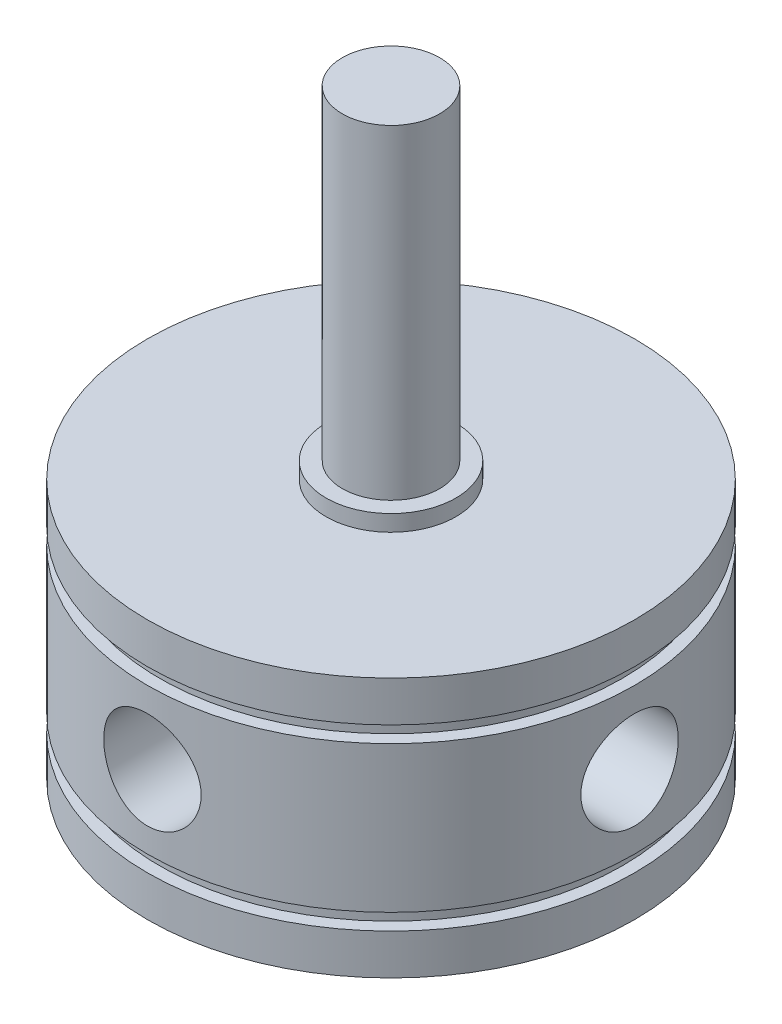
ISO-10303-21;
HEADER;
FILE_DESCRIPTION(('STEP AP214'),'2;1');
FILE_NAME('part.step','',(''),(''),'','','');
FILE_SCHEMA(('AUTOMOTIVE_DESIGN { 1 0 10303 214 1 1 1 1 }'));
ENDSEC;
DATA;
#1=APPLICATION_CONTEXT('core data for automotive mechanical design processes');
#2=APPLICATION_PROTOCOL_DEFINITION('international standard','automotive_design',2000,#1);
#3=PRODUCT_CONTEXT('',#1,'mechanical');
#4=PRODUCT('Part','Part','',(#3));
#5=PRODUCT_RELATED_PRODUCT_CATEGORY('part','',(#4));
#6=PRODUCT_DEFINITION_FORMATION('','',#4);
#7=PRODUCT_DEFINITION_CONTEXT('part definition',#1,'design');
#8=PRODUCT_DEFINITION('design','',#6,#7);
#9=PRODUCT_DEFINITION_SHAPE('','',#8);
#10=(LENGTH_UNIT() NAMED_UNIT(*) SI_UNIT(.MILLI.,.METRE.));
#11=(NAMED_UNIT(*) PLANE_ANGLE_UNIT() SI_UNIT($,.RADIAN.));
#12=(NAMED_UNIT(*) SI_UNIT($,.STERADIAN.) SOLID_ANGLE_UNIT());
#13=UNCERTAINTY_MEASURE_WITH_UNIT(LENGTH_MEASURE(1.E-05),#10,'distance_accuracy_value','');
#14=(GEOMETRIC_REPRESENTATION_CONTEXT(3) GLOBAL_UNCERTAINTY_ASSIGNED_CONTEXT((#13)) GLOBAL_UNIT_ASSIGNED_CONTEXT((#10,
#11,#12)) REPRESENTATION_CONTEXT('',''));
#15=CARTESIAN_POINT('',(0.,0.,0.));
#16=DIRECTION('',(0.,0.,1.));
#17=DIRECTION('',(1.,0.,0.));
#18=AXIS2_PLACEMENT_3D('',#15,#16,#17);
#19=CARTESIAN_POINT('',(0.,52.8834340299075,0.));
#20=DIRECTION('',(0.,1.,0.));
#21=DIRECTION('',(-1.,0.,0.));
#22=AXIS2_PLACEMENT_3D('',#19,#20,#21);
#23=CYLINDRICAL_SURFACE('',#22,15.);
#24=CARTESIAN_POINT('',(3.,12.,14.6969384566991));
#25=CARTESIAN_POINT('',(2.99999383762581,11.8333068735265,14.6969417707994));
#26=CARTESIAN_POINT('',(2.98605951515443,11.66653613,14.699805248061));
#27=CARTESIAN_POINT('',(2.93073685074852,11.3377124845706,14.7109329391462));
#28=CARTESIAN_POINT('',(2.88932654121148,11.1756634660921,14.7192014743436));
#29=CARTESIAN_POINT('',(2.78038734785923,10.8610880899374,14.7401662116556));
#30=CARTESIAN_POINT('',(2.71288444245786,10.7085524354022,14.7528580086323));
#31=CARTESIAN_POINT('',(2.55374732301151,10.4169754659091,14.7812339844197));
#32=CARTESIAN_POINT('',(2.46211445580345,10.2779333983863,14.7969179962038));
#33=CARTESIAN_POINT('',(2.25593722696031,10.0153169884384,14.8297589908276));
#34=CARTESIAN_POINT('',(2.14111696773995,9.89196123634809,14.8469321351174));
#35=CARTESIAN_POINT('',(1.89242036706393,9.66612739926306,14.8806741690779));
#36=CARTESIAN_POINT('',(1.75854269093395,9.56365077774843,14.8972430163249));
#37=CARTESIAN_POINT('',(1.47408406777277,9.38163594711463,14.9280838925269));
#38=CARTESIAN_POINT('',(1.32336770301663,9.30230545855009,14.9423346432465));
#39=CARTESIAN_POINT('',(1.01041245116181,9.17017518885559,14.9667521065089));
#40=CARTESIAN_POINT('',(0.848174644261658,9.11737292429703,14.9769192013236));
#41=CARTESIAN_POINT('',(0.519050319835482,9.04047841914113,14.9919096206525));
#42=CARTESIAN_POINT('',(0.352253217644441,9.01601706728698,14.9968015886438));
#43=CARTESIAN_POINT('',(0.016855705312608,8.99534714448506,15.0009276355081));
#44=CARTESIAN_POINT('',(-0.15174452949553,8.99913585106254,15.0001622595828));
#45=CARTESIAN_POINT('',(-0.483426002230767,9.03457854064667,14.9931130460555));
#46=CARTESIAN_POINT('',(-0.646551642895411,9.06583493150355,14.9869079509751));
#47=CARTESIAN_POINT('',(-0.965194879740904,9.15469509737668,14.9697653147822));
#48=CARTESIAN_POINT('',(-1.12071217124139,9.21229992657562,14.9588275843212));
#49=CARTESIAN_POINT('',(-1.42085838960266,9.35259012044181,14.9333188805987));
#50=CARTESIAN_POINT('',(-1.5654125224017,9.43543125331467,14.9187254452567));
#51=CARTESIAN_POINT('',(-1.83871513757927,9.6237272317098,14.8875140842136));
#52=CARTESIAN_POINT('',(-1.967461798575,9.72918467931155,14.8708959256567));
#53=CARTESIAN_POINT('',(-2.20785429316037,9.96190086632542,14.8371289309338));
#54=CARTESIAN_POINT('',(-2.31916294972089,10.0895075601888,14.8199758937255));
#55=CARTESIAN_POINT('',(-2.51885547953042,10.3617493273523,14.7873471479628));
#56=CARTESIAN_POINT('',(-2.60723891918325,10.5063847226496,14.7718714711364));
#57=CARTESIAN_POINT('',(-2.75868844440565,10.8090624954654,14.7443414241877));
#58=CARTESIAN_POINT('',(-2.82169994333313,10.967132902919,14.7322944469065));
#59=CARTESIAN_POINT('',(-2.92017102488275,11.291913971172,14.7130942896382));
#60=CARTESIAN_POINT('',(-2.95563419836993,11.4586235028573,14.7059404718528));
#61=CARTESIAN_POINT('',(-2.99749801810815,11.7928945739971,14.6974643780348));
#62=CARTESIAN_POINT('',(-3.00438557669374,11.960392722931,14.6960444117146));
#63=CARTESIAN_POINT('',(-2.99021288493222,12.2941446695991,14.6989345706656));
#64=CARTESIAN_POINT('',(-2.96915421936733,12.4603985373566,14.7032443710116));
#65=CARTESIAN_POINT('',(-2.90010662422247,12.7853059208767,14.7170169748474));
#66=CARTESIAN_POINT('',(-2.8523778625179,12.9440170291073,14.7264299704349));
#67=CARTESIAN_POINT('',(-2.73162310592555,13.2511898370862,14.7493046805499));
#68=CARTESIAN_POINT('',(-2.65859502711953,13.3996506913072,14.7627667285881));
#69=CARTESIAN_POINT('',(-2.4882124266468,13.6842393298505,14.7924421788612));
#70=CARTESIAN_POINT('',(-2.39055323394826,13.8201811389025,14.8086891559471));
#71=CARTESIAN_POINT('',(-2.17408671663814,14.0739249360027,14.8420117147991));
#72=CARTESIAN_POINT('',(-2.05527721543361,14.1917250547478,14.8590873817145));
#73=CARTESIAN_POINT('',(-1.79769682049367,14.4076876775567,14.8924603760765));
#74=CARTESIAN_POINT('',(-1.65864749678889,14.50552096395,14.9087417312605));
#75=CARTESIAN_POINT('',(-1.36580368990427,14.6764376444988,14.9384138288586));
#76=CARTESIAN_POINT('',(-1.21200982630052,14.7495220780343,14.9518046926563));
#77=CARTESIAN_POINT('',(-0.89490804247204,14.8683866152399,14.974118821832));
#78=CARTESIAN_POINT('',(-0.731660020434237,14.9143215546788,14.9830673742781));
#79=CARTESIAN_POINT('',(-0.399568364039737,14.9780737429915,14.9955970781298));
#80=CARTESIAN_POINT('',(-0.230725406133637,14.995894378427,14.9991788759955));
#81=CARTESIAN_POINT('',(0.104618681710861,15.0027809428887,15.0005562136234));
#82=CARTESIAN_POINT('',(0.271109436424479,14.9923418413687,14.9984513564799));
#83=CARTESIAN_POINT('',(0.599913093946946,14.9440981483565,14.9889013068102));
#84=CARTESIAN_POINT('',(0.762226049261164,14.9062939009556,14.9814561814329));
#85=CARTESIAN_POINT('',(1.07775824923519,14.8046130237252,14.9620649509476));
#86=CARTESIAN_POINT('',(1.23099732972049,14.7407958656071,14.9501291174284));
#87=CARTESIAN_POINT('',(1.5246636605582,14.5889632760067,14.9230416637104));
#88=CARTESIAN_POINT('',(1.66508989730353,14.5009459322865,14.9078897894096));
#89=CARTESIAN_POINT('',(1.93159167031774,14.3015418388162,14.8757279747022));
#90=CARTESIAN_POINT('',(2.05739914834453,14.1898009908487,14.858692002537));
#91=CARTESIAN_POINT('',(2.28864785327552,13.9468492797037,14.8248366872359));
#92=CARTESIAN_POINT('',(2.39408424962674,13.8156338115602,14.8080173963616));
#93=CARTESIAN_POINT('',(2.58267665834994,13.5357620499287,14.7763002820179));
#94=CARTESIAN_POINT('',(2.66558044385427,13.3869331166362,14.7614251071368));
#95=CARTESIAN_POINT('',(2.80507214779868,13.0772016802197,14.7355571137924));
#96=CARTESIAN_POINT('',(2.86168393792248,12.9163102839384,14.7245607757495));
#97=CARTESIAN_POINT('',(2.93600741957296,12.6292126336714,14.7098904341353));
#98=CARTESIAN_POINT('',(2.95996169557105,12.5046437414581,14.7050635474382));
#99=CARTESIAN_POINT('',(2.99196005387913,12.2533981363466,14.6985863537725));
#100=CARTESIAN_POINT('',(3.00000468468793,12.1267214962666,14.6969359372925));
#101=CARTESIAN_POINT('',(3.,12.,14.6969384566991));
#102=B_SPLINE_CURVE_WITH_KNOTS('',3,(#24,#25,#26,#27,#28,#29,#30,#31,#32,#33,#34,#35,#36,#37,
#38,#39,#40,#41,#42,#43,#44,#45,#46,#47,#48,#49,#50,#51,#52,#53,#54,#55,#56,#57,#58,#59,#60,#61,
#62,#63,#64,#65,#66,#67,#68,#69,#70,#71,#72,#73,#74,#75,#76,#77,#78,#79,#80,#81,#82,#83,#84,#85,
#86,#87,#88,#89,#90,#91,#92,#93,#94,#95,#96,#97,#98,#99,#100,#101),.UNSPECIFIED.,.T.,.F.,(4,2,2,
2,2,2,2,2,2,2,2,2,2,2,2,2,2,2,2,2,2,2,2,2,2,2,2,2,2,2,2,2,2,2,2,2,2,2,4),(0.,0.499615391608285,
0.999630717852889,1.49914949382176,1.99864039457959,2.5044675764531,3.01033020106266,
3.52060201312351,4.03082604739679,4.53432746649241,5.03778036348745,5.53406368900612,
6.03036687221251,6.5297977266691,7.02928607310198,7.5374804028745,8.04568434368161,
8.5549758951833,9.06420105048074,9.5647127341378,10.0651960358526,10.5608802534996,
11.0566053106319,11.5587917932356,12.0610299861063,12.5709780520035,13.0809046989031,
13.5878944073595,14.0948230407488,14.5929305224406,15.0910317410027,15.5880005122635,
16.0850085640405,16.5900345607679,17.0951801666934,17.6057669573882,18.1158892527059,
18.4957141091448,18.8755258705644),.UNSPECIFIED.);
#103=CARTESIAN_POINT('',(3.,12.,14.6969384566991));
#104=VERTEX_POINT('',#103);
#105=EDGE_CURVE('E133',#104,#104,#102,.T.);
#106=ORIENTED_EDGE('',*,*,#105,.T.);
#107=EDGE_LOOP('',(#106));
#108=FACE_BOUND('',#107,.T.);
#109=CARTESIAN_POINT('',(-15.,15.,0.));
#110=CARTESIAN_POINT('',(-14.9999969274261,14.9999938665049,0.166730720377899));
#111=CARTESIAN_POINT('',(-14.9971915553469,14.986053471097,0.333538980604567));
#112=CARTESIAN_POINT('',(-14.9862709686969,14.9307044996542,0.662440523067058));
#113=CARTESIAN_POINT('',(-14.9781515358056,14.8892741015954,0.824529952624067));
#114=CARTESIAN_POINT('',(-14.9575094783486,14.7802761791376,1.13919091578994));
#115=CARTESIAN_POINT('',(-14.9449910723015,14.7127336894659,1.2917714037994));
#116=CARTESIAN_POINT('',(-14.9169119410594,14.5535032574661,1.58342396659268));
#117=CARTESIAN_POINT('',(-14.9013513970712,14.4618167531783,1.72249684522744));
#118=CARTESIAN_POINT('',(-14.8686649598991,14.2555845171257,1.9850804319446));
#119=CARTESIAN_POINT('',(-14.8515223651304,14.1407749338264,2.10838185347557));
#120=CARTESIAN_POINT('',(-14.8177254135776,13.8921227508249,2.33411026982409));
#121=CARTESIAN_POINT('',(-14.8010710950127,13.7582786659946,2.43653563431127));
#122=CARTESIAN_POINT('',(-14.7699732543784,13.4738514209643,2.61849526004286));
#123=CARTESIAN_POINT('',(-14.7555512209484,13.3231270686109,2.6978128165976));
#124=CARTESIAN_POINT('',(-14.7307880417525,13.0101545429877,2.82991699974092));
#125=CARTESIAN_POINT('',(-14.7204464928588,12.8479075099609,2.88270624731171));
#126=CARTESIAN_POINT('',(-14.7051841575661,12.5187469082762,2.95957589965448));
#127=CARTESIAN_POINT('',(-14.7001941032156,12.3519223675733,2.98402349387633));
#128=CARTESIAN_POINT('',(-14.6959912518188,12.0164705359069,3.00465638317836));
#129=CARTESIAN_POINT('',(-14.6967778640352,11.8478434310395,3.0008445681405));
#130=CARTESIAN_POINT('',(-14.7039765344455,11.5162596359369,2.96536371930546));
#131=CARTESIAN_POINT('',(-14.7103035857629,11.353255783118,2.93411562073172));
#132=CARTESIAN_POINT('',(-14.7277363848,11.034851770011,2.84531365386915));
#133=CARTESIAN_POINT('',(-14.7388423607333,10.8794519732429,2.78775852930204));
#134=CARTESIAN_POINT('',(-14.7646685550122,10.5794542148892,2.64757435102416));
#135=CARTESIAN_POINT('',(-14.7794126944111,10.4349363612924,2.56477845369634));
#136=CARTESIAN_POINT('',(-14.8108385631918,10.1616874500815,2.37658072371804));
#137=CARTESIAN_POINT('',(-14.827520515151,10.0329582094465,2.27117629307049));
#138=CARTESIAN_POINT('',(-14.8613106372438,9.79251179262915,2.03849980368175));
#139=CARTESIAN_POINT('',(-14.8784210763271,9.68114229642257,1.91086848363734));
#140=CARTESIAN_POINT('',(-14.9108654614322,9.48133846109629,1.63855507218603));
#141=CARTESIAN_POINT('',(-14.9261993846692,9.39290441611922,1.49387276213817));
#142=CARTESIAN_POINT('',(-14.9534007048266,9.24141747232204,1.19117816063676));
#143=CARTESIAN_POINT('',(-14.9652626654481,9.17840431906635,1.0331454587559));
#144=CARTESIAN_POINT('',(-14.9841422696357,9.07991857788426,0.708446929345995));
#145=CARTESIAN_POINT('',(-14.9911605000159,9.04444265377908,0.541782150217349));
#146=CARTESIAN_POINT('',(-14.999480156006,9.00253063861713,0.207538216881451));
#147=CARTESIAN_POINT('',(-15.0008752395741,8.99561874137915,0.0400209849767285));
#148=CARTESIAN_POINT('',(-14.9980515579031,9.0097495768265,-0.293774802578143));
#149=CARTESIAN_POINT('',(-14.9938331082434,9.03079073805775,-0.46005342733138));
#150=CARTESIAN_POINT('',(-14.9803149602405,9.09983512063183,-0.785116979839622));
#151=CARTESIAN_POINT('',(-14.9710612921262,9.14759420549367,-0.943955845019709));
#152=CARTESIAN_POINT('',(-14.948506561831,9.26845194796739,-1.251370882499));
#153=CARTESIAN_POINT('',(-14.9352051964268,9.34155250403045,-1.39994628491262));
#154=CARTESIAN_POINT('',(-14.9057973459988,9.5120474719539,-1.68462352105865));
#155=CARTESIAN_POINT('',(-14.8896585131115,9.6097283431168,-1.82055038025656));
#156=CARTESIAN_POINT('',(-14.8564420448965,9.8262275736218,-2.07425405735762));
#157=CARTESIAN_POINT('',(-14.8393643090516,9.94504819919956,-2.19202892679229));
#158=CARTESIAN_POINT('',(-14.8058791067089,10.2026200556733,-2.40792177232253));
#159=CARTESIAN_POINT('',(-14.7894858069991,10.341647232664,-2.50571310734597));
#160=CARTESIAN_POINT('',(-14.7595257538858,10.63443408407,-2.67655626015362));
#161=CARTESIAN_POINT('',(-14.7459588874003,10.7881931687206,-2.74960906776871));
#162=CARTESIAN_POINT('',(-14.7233022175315,11.1053047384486,-2.86845552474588));
#163=CARTESIAN_POINT('',(-14.7141892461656,11.2686025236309,-2.91439049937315));
#164=CARTESIAN_POINT('',(-14.7014231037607,11.6008003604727,-2.97812595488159));
#165=CARTESIAN_POINT('',(-14.6977692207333,11.769699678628,-2.99593010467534));
#166=CARTESIAN_POINT('',(-14.6963744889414,12.1050265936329,-3.00276273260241));
#167=CARTESIAN_POINT('',(-14.698527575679,12.271443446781,-2.99230736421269));
#168=CARTESIAN_POINT('',(-14.7082672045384,12.600094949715,-2.94405691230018));
#169=CARTESIAN_POINT('',(-14.7158537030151,12.7623296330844,-2.90626204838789));
#170=CARTESIAN_POINT('',(-14.7355579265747,13.0776831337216,-2.80463570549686));
#171=CARTESIAN_POINT('',(-14.7476646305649,13.2308230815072,-2.74086752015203));
#172=CARTESIAN_POINT('',(-14.7750514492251,13.5243111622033,-2.58916393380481));
#173=CARTESIAN_POINT('',(-14.7903318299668,13.6646582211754,-2.50122650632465));
#174=CARTESIAN_POINT('',(-14.8226688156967,13.9311467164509,-2.30191774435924));
#175=CARTESIAN_POINT('',(-14.839751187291,14.0570062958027,-2.19017366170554));
#176=CARTESIAN_POINT('',(-14.8735824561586,14.2883586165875,-1.94719310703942));
#177=CARTESIAN_POINT('',(-14.8903312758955,14.3938466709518,-1.81595216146));
#178=CARTESIAN_POINT('',(-14.9218149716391,14.5825039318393,-1.53605288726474));
#179=CARTESIAN_POINT('',(-14.9365269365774,14.66542800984,-1.3872266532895));
#180=CARTESIAN_POINT('',(-14.96205375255,14.8049583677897,-1.0774990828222));
#181=CARTESIAN_POINT('',(-14.9728721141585,14.8615883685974,-0.916608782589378));
#182=CARTESIAN_POINT('',(-14.9872911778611,14.9359558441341,-0.629464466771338));
#183=CARTESIAN_POINT('',(-14.9920290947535,14.9599295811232,-0.504844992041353));
#184=CARTESIAN_POINT('',(-14.9983846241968,14.9919537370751,-0.2534985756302));
#185=CARTESIAN_POINT('',(-15.0000023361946,15.0000046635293,-0.126771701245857));
#186=CARTESIAN_POINT('',(-15.,15.,0.));
#187=B_SPLINE_CURVE_WITH_KNOTS('',3,(#109,#110,#111,#112,#113,#114,#115,#116,#117,#118,#119,
#120,#121,#122,#123,#124,#125,#126,#127,#128,#129,#130,#131,#132,#133,#134,#135,#136,#137,#138,
#139,#140,#141,#142,#143,#144,#145,#146,#147,#148,#149,#150,#151,#152,#153,#154,#155,#156,#157,
#158,#159,#160,#161,#162,#163,#164,#165,#166,#167,#168,#169,#170,#171,#172,#173,#174,#175,#176,
#177,#178,#179,#180,#181,#182,#183,#184,#185,#186),.UNSPECIFIED.,.T.,.F.,(4,2,2,2,2,2,2,2,2,2,2,
2,2,2,2,2,2,2,2,2,2,2,2,2,2,2,2,2,2,2,2,2,2,2,2,2,2,2,4),(0.,0.499728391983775,0.99985395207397,
1.49950120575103,1.99911870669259,2.50479801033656,3.0105167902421,3.52083585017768,
4.03110448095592,4.53468555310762,5.03821512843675,5.53415181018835,6.03011217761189,
6.52942470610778,7.02879464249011,7.53714757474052,8.04550702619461,8.55465824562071,
9.06374777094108,9.56432207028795,10.064868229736,10.5609136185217,11.0569961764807,
11.5591519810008,12.0613616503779,12.5712188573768,13.081055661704,13.5882114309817,
14.0953010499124,14.593191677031,15.0910783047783,15.5877588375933,16.084481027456,
16.5896422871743,17.0949196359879,17.6054849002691,18.1155886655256,18.4955632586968,
18.8755257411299),.UNSPECIFIED.);
#188=CARTESIAN_POINT('',(-15.,15.,0.));
#189=VERTEX_POINT('',#188);
#190=EDGE_CURVE('E59',#189,#189,#187,.T.);
#191=ORIENTED_EDGE('',*,*,#190,.T.);
#192=EDGE_LOOP('',(#191));
#193=FACE_BOUND('',#192,.T.);
#194=CARTESIAN_POINT('',(15.,15.,0.));
#195=CARTESIAN_POINT('',(14.9999969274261,14.9999938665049,-0.1667307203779));
#196=CARTESIAN_POINT('',(14.9971915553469,14.986053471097,-0.333538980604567));
#197=CARTESIAN_POINT('',(14.9862709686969,14.9307044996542,-0.662440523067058));
#198=CARTESIAN_POINT('',(14.9781515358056,14.8892741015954,-0.824529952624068));
#199=CARTESIAN_POINT('',(14.9575094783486,14.7802761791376,-1.13919091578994));
#200=CARTESIAN_POINT('',(14.9449910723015,14.7127336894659,-1.2917714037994));
#201=CARTESIAN_POINT('',(14.9169119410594,14.5535032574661,-1.58342396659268));
#202=CARTESIAN_POINT('',(14.9013513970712,14.4618167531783,-1.72249684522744));
#203=CARTESIAN_POINT('',(14.8686649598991,14.2555845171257,-1.9850804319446));
#204=CARTESIAN_POINT('',(14.8515223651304,14.1407749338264,-2.10838185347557));
#205=CARTESIAN_POINT('',(14.8177254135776,13.8921227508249,-2.33411026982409));
#206=CARTESIAN_POINT('',(14.8010710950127,13.7582786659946,-2.43653563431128));
#207=CARTESIAN_POINT('',(14.7699732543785,13.4738514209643,-2.61849526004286));
#208=CARTESIAN_POINT('',(14.7555512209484,13.3231270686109,-2.6978128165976));
#209=CARTESIAN_POINT('',(14.7307880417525,13.0101545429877,-2.82991699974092));
#210=CARTESIAN_POINT('',(14.7204464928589,12.8479075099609,-2.88270624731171));
#211=CARTESIAN_POINT('',(14.7051841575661,12.5187469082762,-2.95957589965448));
#212=CARTESIAN_POINT('',(14.7001941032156,12.3519223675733,-2.98402349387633));
#213=CARTESIAN_POINT('',(14.6959912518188,12.0164705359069,-3.00465638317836));
#214=CARTESIAN_POINT('',(14.6967778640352,11.8478434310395,-3.0008445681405));
#215=CARTESIAN_POINT('',(14.7039765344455,11.516259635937,-2.96536371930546));
#216=CARTESIAN_POINT('',(14.7103035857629,11.353255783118,-2.93411562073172));
#217=CARTESIAN_POINT('',(14.7277363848,11.034851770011,-2.84531365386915));
#218=CARTESIAN_POINT('',(14.7388423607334,10.8794519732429,-2.78775852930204));
#219=CARTESIAN_POINT('',(14.7646685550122,10.5794542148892,-2.64757435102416));
#220=CARTESIAN_POINT('',(14.7794126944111,10.4349363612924,-2.56477845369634));
#221=CARTESIAN_POINT('',(14.8108385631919,10.1616874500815,-2.37658072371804));
#222=CARTESIAN_POINT('',(14.827520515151,10.0329582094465,-2.27117629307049));
#223=CARTESIAN_POINT('',(14.8613106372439,9.79251179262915,-2.03849980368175));
#224=CARTESIAN_POINT('',(14.8784210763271,9.68114229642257,-1.91086848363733));
#225=CARTESIAN_POINT('',(14.9108654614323,9.48133846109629,-1.63855507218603));
#226=CARTESIAN_POINT('',(14.9261993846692,9.39290441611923,-1.49387276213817));
#227=CARTESIAN_POINT('',(14.9534007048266,9.24141747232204,-1.19117816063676));
#228=CARTESIAN_POINT('',(14.9652626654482,9.17840431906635,-1.0331454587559));
#229=CARTESIAN_POINT('',(14.9841422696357,9.07991857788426,-0.708446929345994));
#230=CARTESIAN_POINT('',(14.9911605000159,9.04444265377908,-0.541782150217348));
#231=CARTESIAN_POINT('',(14.999480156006,9.00253063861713,-0.207538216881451));
#232=CARTESIAN_POINT('',(15.0008752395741,8.99561874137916,-0.0400209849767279));
#233=CARTESIAN_POINT('',(14.9980515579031,9.00974957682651,0.293774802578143));
#234=CARTESIAN_POINT('',(14.9938331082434,9.03079073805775,0.46005342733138));
#235=CARTESIAN_POINT('',(14.9803149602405,9.09983512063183,0.785116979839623));
#236=CARTESIAN_POINT('',(14.9710612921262,9.14759420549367,0.943955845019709));
#237=CARTESIAN_POINT('',(14.948506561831,9.26845194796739,1.251370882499));
#238=CARTESIAN_POINT('',(14.9352051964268,9.34155250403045,1.39994628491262));
#239=CARTESIAN_POINT('',(14.9057973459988,9.5120474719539,1.68462352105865));
#240=CARTESIAN_POINT('',(14.8896585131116,9.6097283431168,1.82055038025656));
#241=CARTESIAN_POINT('',(14.8564420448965,9.82622757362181,2.07425405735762));
#242=CARTESIAN_POINT('',(14.8393643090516,9.94504819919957,2.19202892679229));
#243=CARTESIAN_POINT('',(14.8058791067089,10.2026200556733,2.40792177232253));
#244=CARTESIAN_POINT('',(14.7894858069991,10.341647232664,2.50571310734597));
#245=CARTESIAN_POINT('',(14.7595257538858,10.63443408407,2.67655626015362));
#246=CARTESIAN_POINT('',(14.7459588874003,10.7881931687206,2.74960906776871));
#247=CARTESIAN_POINT('',(14.7233022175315,11.1053047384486,2.86845552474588));
#248=CARTESIAN_POINT('',(14.7141892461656,11.2686025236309,2.91439049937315));
#249=CARTESIAN_POINT('',(14.7014231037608,11.6008003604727,2.97812595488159));
#250=CARTESIAN_POINT('',(14.6977692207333,11.769699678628,2.99593010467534));
#251=CARTESIAN_POINT('',(14.6963744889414,12.1050265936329,3.00276273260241));
#252=CARTESIAN_POINT('',(14.698527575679,12.271443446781,2.99230736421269));
#253=CARTESIAN_POINT('',(14.7082672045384,12.600094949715,2.94405691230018));
#254=CARTESIAN_POINT('',(14.7158537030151,12.7623296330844,2.90626204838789));
#255=CARTESIAN_POINT('',(14.7355579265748,13.0776831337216,2.80463570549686));
#256=CARTESIAN_POINT('',(14.7476646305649,13.2308230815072,2.74086752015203));
#257=CARTESIAN_POINT('',(14.7750514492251,13.5243111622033,2.58916393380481));
#258=CARTESIAN_POINT('',(14.7903318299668,13.6646582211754,2.50122650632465));
#259=CARTESIAN_POINT('',(14.8226688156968,13.9311467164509,2.30191774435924));
#260=CARTESIAN_POINT('',(14.839751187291,14.0570062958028,2.19017366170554));
#261=CARTESIAN_POINT('',(14.8735824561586,14.2883586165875,1.94719310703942));
#262=CARTESIAN_POINT('',(14.8903312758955,14.3938466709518,1.81595216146));
#263=CARTESIAN_POINT('',(14.9218149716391,14.5825039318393,1.53605288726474));
#264=CARTESIAN_POINT('',(14.9365269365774,14.66542800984,1.3872266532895));
#265=CARTESIAN_POINT('',(14.96205375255,14.8049583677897,1.0774990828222));
#266=CARTESIAN_POINT('',(14.9728721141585,14.8615883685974,0.916608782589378));
#267=CARTESIAN_POINT('',(14.9872911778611,14.9359558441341,0.629464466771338));
#268=CARTESIAN_POINT('',(14.9920290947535,14.9599295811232,0.504844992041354));
#269=CARTESIAN_POINT('',(14.9983846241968,14.9919537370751,0.253498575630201));
#270=CARTESIAN_POINT('',(15.0000023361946,15.0000046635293,0.126771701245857));
#271=CARTESIAN_POINT('',(15.,15.,0.));
#272=B_SPLINE_CURVE_WITH_KNOTS('',3,(#194,#195,#196,#197,#198,#199,#200,#201,#202,#203,#204,
#205,#206,#207,#208,#209,#210,#211,#212,#213,#214,#215,#216,#217,#218,#219,#220,#221,#222,#223,
#224,#225,#226,#227,#228,#229,#230,#231,#232,#233,#234,#235,#236,#237,#238,#239,#240,#241,#242,
#243,#244,#245,#246,#247,#248,#249,#250,#251,#252,#253,#254,#255,#256,#257,#258,#259,#260,#261,
#262,#263,#264,#265,#266,#267,#268,#269,#270,#271),.UNSPECIFIED.,.T.,.F.,(4,2,2,2,2,2,2,2,2,2,2,
2,2,2,2,2,2,2,2,2,2,2,2,2,2,2,2,2,2,2,2,2,2,2,2,2,2,2,4),(0.,0.499728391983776,0.99985395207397,
1.49950120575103,1.99911870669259,2.50479801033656,3.0105167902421,3.52083585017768,
4.03110448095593,4.53468555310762,5.03821512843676,5.53415181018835,6.03011217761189,
6.52942470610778,7.02879464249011,7.53714757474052,8.04550702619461,8.55465824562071,
9.06374777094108,9.56432207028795,10.064868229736,10.5609136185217,11.0569961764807,
11.5591519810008,12.0613616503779,12.5712188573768,13.081055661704,13.5882114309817,
14.0953010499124,14.593191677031,15.0910783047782,15.5877588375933,16.084481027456,
16.5896422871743,17.0949196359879,17.6054849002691,18.1155886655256,18.4955632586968,
18.8755257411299),.UNSPECIFIED.);
#273=CARTESIAN_POINT('',(15.,15.,0.));
#274=VERTEX_POINT('',#273);
#275=EDGE_CURVE('E73',#274,#274,#272,.T.);
#276=ORIENTED_EDGE('',*,*,#275,.T.);
#277=EDGE_LOOP('',(#276));
#278=FACE_BOUND('',#277,.T.);
#279=CARTESIAN_POINT('',(0.,16.5,0.));
#280=DIRECTION('',(0.,1.,0.));
#281=DIRECTION('',(-1.,0.,0.));
#282=AXIS2_PLACEMENT_3D('',#279,#280,#281);
#283=CIRCLE('',#282,15.);
#284=CARTESIAN_POINT('',(-15.,16.5,0.));
#285=VERTEX_POINT('',#284);
#286=EDGE_CURVE('E142',#285,#285,#283,.T.);
#287=ORIENTED_EDGE('',*,*,#286,.F.);
#288=EDGE_LOOP('',(#287));
#289=FACE_BOUND('',#288,.T.);
#290=CARTESIAN_POINT('',(0.,7.49999999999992,0.));
#291=DIRECTION('',(0.,1.,0.));
#292=DIRECTION('',(-1.,0.,0.));
#293=AXIS2_PLACEMENT_3D('',#290,#291,#292);
#294=CIRCLE('',#293,15.);
#295=CARTESIAN_POINT('',(-15.,7.49999999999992,0.));
#296=VERTEX_POINT('',#295);
#297=EDGE_CURVE('E145',#296,#296,#294,.T.);
#298=ORIENTED_EDGE('',*,*,#297,.T.);
#299=EDGE_LOOP('',(#298));
#300=FACE_BOUND('',#299,.T.);
#301=CARTESIAN_POINT('',(3.49227122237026,12.,-14.5878045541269));
#302=CARTESIAN_POINT('',(3.49227820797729,12.1666931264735,-14.5878049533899));
#303=CARTESIAN_POINT('',(3.50611715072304,12.33346387,-14.5845112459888));
#304=CARTESIAN_POINT('',(3.56095927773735,12.6622875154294,-14.5712159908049));
#305=CARTESIAN_POINT('',(3.60198419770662,12.8243365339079,-14.561209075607));
#306=CARTESIAN_POINT('',(3.70957671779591,13.1389119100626,-14.5341698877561));
#307=CARTESIAN_POINT('',(3.7761189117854,13.2914475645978,-14.5171446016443));
#308=CARTESIAN_POINT('',(3.93233832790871,13.5830245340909,-14.4756077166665));
#309=CARTESIAN_POINT('',(4.02201425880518,13.7220666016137,-14.4510965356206));
#310=CARTESIAN_POINT('',(4.22275349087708,13.9846830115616,-14.3937263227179));
#311=CARTESIAN_POINT('',(4.33407367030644,14.1080387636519,-14.3607653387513));
#312=CARTESIAN_POINT('',(4.57372933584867,14.3338726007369,-14.2862422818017));
#313=CARTESIAN_POINT('',(4.70206601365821,14.4363492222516,-14.244679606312));
#314=CARTESIAN_POINT('',(4.97290699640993,14.6183640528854,-14.1524135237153));
#315=CARTESIAN_POINT('',(5.11552503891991,14.6976945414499,-14.1016336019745));
#316=CARTESIAN_POINT('',(5.40947808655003,14.8298248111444,-13.9915027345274));
#317=CARTESIAN_POINT('',(5.56081227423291,14.882627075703,-13.9321525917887));
#318=CARTESIAN_POINT('',(5.8654354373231,14.9595215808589,-13.8066445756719));
#319=CARTESIAN_POINT('',(6.01867238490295,14.983982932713,-13.7405867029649));
#320=CARTESIAN_POINT('',(6.32438950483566,15.004652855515,-13.6025810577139));
#321=CARTESIAN_POINT('',(6.47686974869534,15.0008641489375,-13.5306338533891));
#322=CARTESIAN_POINT('',(6.77449612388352,14.9654214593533,-13.3840704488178));
#323=CARTESIAN_POINT('',(6.91971577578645,14.9341650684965,-13.3095068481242));
#324=CARTESIAN_POINT('',(7.20125983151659,14.8453049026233,-13.1593058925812));
#325=CARTESIAN_POINT('',(7.33758387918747,14.7877000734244,-13.0836684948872));
#326=CARTESIAN_POINT('',(7.59882829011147,14.6474098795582,-12.9337024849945));
#327=CARTESIAN_POINT('',(7.72367137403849,14.5645687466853,-12.8593851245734));
#328=CARTESIAN_POINT('',(7.95817717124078,14.3762727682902,-12.7155953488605));
#329=CARTESIAN_POINT('',(8.06783813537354,14.2708153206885,-12.6461234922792));
#330=CARTESIAN_POINT('',(8.27143717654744,14.0380991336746,-12.5139259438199));
#331=CARTESIAN_POINT('',(8.36506789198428,13.9104924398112,-12.4513389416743));
#332=CARTESIAN_POINT('',(8.5322612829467,13.6382506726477,-12.3373735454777));
#333=CARTESIAN_POINT('',(8.60582357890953,13.4936152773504,-12.2859953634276));
#334=CARTESIAN_POINT('',(8.73144876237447,13.1909375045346,-12.1970393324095));
#335=CARTESIAN_POINT('',(8.78346530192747,13.032867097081,-12.1594912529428));
#336=CARTESIAN_POINT('',(8.86459607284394,12.708086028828,-12.100474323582));
#337=CARTESIAN_POINT('',(8.89371328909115,12.5413764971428,-12.0790033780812));
#338=CARTESIAN_POINT('',(8.92807264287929,12.2071054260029,-12.0536290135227));
#339=CARTESIAN_POINT('',(8.9337147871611,12.039607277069,-12.0494312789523));
#340=CARTESIAN_POINT('',(8.92209140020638,11.705855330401,-12.0580402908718));
#341=CARTESIAN_POINT('',(8.90482716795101,11.5396014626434,-12.0708460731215));
#342=CARTESIAN_POINT('',(8.8480693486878,11.2146940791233,-12.1125090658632));
#343=CARTESIAN_POINT('',(8.80879050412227,11.0559829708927,-12.1412111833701));
#344=CARTESIAN_POINT('',(8.70901679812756,10.7488101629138,-12.2129758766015));
#345=CARTESIAN_POINT('',(8.64852018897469,10.6003493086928,-12.2560396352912));
#346=CARTESIAN_POINT('',(8.50664249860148,10.3157606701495,-12.3549415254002));
#347=CARTESIAN_POINT('',(8.42499948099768,10.1798188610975,-12.4109388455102));
#348=CARTESIAN_POINT('',(8.24289691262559,9.92607506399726,-12.5326220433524));
#349=CARTESIAN_POINT('',(8.14243542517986,9.80827494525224,-12.5983089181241));
#350=CARTESIAN_POINT('',(7.92309234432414,9.59231232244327,-12.737413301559));
#351=CARTESIAN_POINT('',(7.80395165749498,9.49447903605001,-12.8109340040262));
#352=CARTESIAN_POINT('',(7.55108500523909,9.32356235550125,-12.9615871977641));
#353=CARTESIAN_POINT('',(7.41735965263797,9.25047792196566,-13.0387195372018));
#354=CARTESIAN_POINT('',(7.13939819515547,9.1316133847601,-13.1929560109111));
#355=CARTESIAN_POINT('',(6.99522706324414,9.08567844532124,-13.2700577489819));
#356=CARTESIAN_POINT('',(6.69954509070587,9.02192625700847,-13.4217615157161));
#357=CARTESIAN_POINT('',(6.54803513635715,9.00410562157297,-13.4963638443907));
#358=CARTESIAN_POINT('',(6.24469226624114,8.99721905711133,-13.6393346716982));
#359=CARTESIAN_POINT('',(6.09291084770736,9.00765815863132,-13.7077890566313));
#360=CARTESIAN_POINT('',(5.79087750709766,9.05590185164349,-13.8380922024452));
#361=CARTESIAN_POINT('',(5.64062556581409,9.0937060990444,-13.8999410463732));
#362=CARTESIAN_POINT('',(5.3464611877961,9.19538697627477,-14.0157162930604));
#363=CARTESIAN_POINT('',(5.20253511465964,9.25920413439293,-14.0696603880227));
#364=CARTESIAN_POINT('',(4.92493537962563,9.41103672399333,-14.1692195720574));
#365=CARTESIAN_POINT('',(4.79126252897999,9.4990540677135,-14.2148340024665));
#366=CARTESIAN_POINT('',(4.53613772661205,9.69845816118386,-14.298314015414));
#367=CARTESIAN_POINT('',(4.41491771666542,9.81019900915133,-14.3360427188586));
#368=CARTESIAN_POINT('',(4.1910273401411,10.0531507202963,-14.4030893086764));
#369=CARTESIAN_POINT('',(4.08836137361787,10.1843661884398,-14.4324052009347));
#370=CARTESIAN_POINT('',(3.9040343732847,10.4642379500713,-14.4833623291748));
#371=CARTESIAN_POINT('',(3.82261150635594,10.6130668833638,-14.5049174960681));
#372=CARTESIAN_POINT('',(3.68525680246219,10.9227983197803,-14.5404248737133));
#373=CARTESIAN_POINT('',(3.62930184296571,11.0836897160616,-14.5543839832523));
#374=CARTESIAN_POINT('',(3.55574193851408,11.3707873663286,-14.5724985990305));
#375=CARTESIAN_POINT('',(3.53199206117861,11.4953562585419,-14.5782474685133));
#376=CARTESIAN_POINT('',(3.50025431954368,11.7466018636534,-14.5859002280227));
#377=CARTESIAN_POINT('',(3.49226591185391,11.8732785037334,-14.5878042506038));
#378=CARTESIAN_POINT('',(3.49227122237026,12.,-14.5878045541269));
#379=B_SPLINE_CURVE_WITH_KNOTS('',3,(#301,#302,#303,#304,#305,#306,#307,#308,#309,#310,#311,
#312,#313,#314,#315,#316,#317,#318,#319,#320,#321,#322,#323,#324,#325,#326,#327,#328,#329,#330,
#331,#332,#333,#334,#335,#336,#337,#338,#339,#340,#341,#342,#343,#344,#345,#346,#347,#348,#349,
#350,#351,#352,#353,#354,#355,#356,#357,#358,#359,#360,#361,#362,#363,#364,#365,#366,#367,#368,
#369,#370,#371,#372,#373,#374,#375,#376,#377,#378),.UNSPECIFIED.,.T.,.F.,(4,2,2,2,2,2,2,2,2,2,2,
2,2,2,2,2,2,2,2,2,2,2,2,2,2,2,2,2,2,2,2,2,2,2,2,2,2,2,4),(0.,0.499615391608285,
0.999630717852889,1.49914949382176,1.99864039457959,2.5044675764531,3.01033020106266,
3.5206020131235,4.03082604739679,4.53432746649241,5.03778036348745,5.53406368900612,
6.03036687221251,6.52979772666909,7.02928607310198,7.5374804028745,8.04568434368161,
8.5549758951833,9.06420105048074,9.5647127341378,10.0651960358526,10.5608802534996,
11.0566053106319,11.5587917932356,12.0610299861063,12.5709780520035,13.0809046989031,
13.5878944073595,14.0948230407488,14.5929305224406,15.0910317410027,15.5880005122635,
16.0850085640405,16.5900345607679,17.0951801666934,17.6057669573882,18.1158892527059,
18.4957141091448,18.8755258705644),.UNSPECIFIED.);
#380=CARTESIAN_POINT('',(3.49227122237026,12.,-14.5878045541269));
#381=VERTEX_POINT('',#380);
#382=EDGE_CURVE('E148',#381,#381,#379,.T.);
#383=ORIENTED_EDGE('',*,*,#382,.F.);
#384=EDGE_LOOP('',(#383));
#385=FACE_BOUND('',#384,.T.);
#386=ADVANCED_FACE('F34',(#108,#193,#278,#289,#300,#385),#23,.T.);
#387=CARTESIAN_POINT('',(-15.,12.,0.));
#388=DIRECTION('',(1.,0.,0.));
#389=DIRECTION('',(0.,1.,0.));
#390=AXIS2_PLACEMENT_3D('',#387,#388,#389);
#391=CYLINDRICAL_SURFACE('',#390,3.);
#392=ORIENTED_EDGE('',*,*,#190,.F.);
#393=EDGE_LOOP('',(#392));
#394=FACE_BOUND('',#393,.T.);
#395=CARTESIAN_POINT('',(0.,12.,0.));
#396=DIRECTION('',(0.843391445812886,0.,-0.537299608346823));
#397=DIRECTION('',(0.537299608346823,0.,0.843391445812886));
#398=AXIS2_PLACEMENT_3D('',#395,#396,#397);
#399=ELLIPSE('',#398,3.55706714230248,3.);
#400=CARTESIAN_POINT('',(0.,15.,0.));
#401=VERTEX_POINT('',#400);
#402=CARTESIAN_POINT('',(0.,8.99999999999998,0.));
#403=VERTEX_POINT('',#402);
#404=EDGE_CURVE('E12',#401,#403,#399,.F.);
#405=ORIENTED_EDGE('',*,*,#404,.F.);
#406=CARTESIAN_POINT('',(0.,12.,0.));
#407=DIRECTION('',(0.707106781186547,0.,0.707106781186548));
#408=DIRECTION('',(0.707106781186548,0.,-0.707106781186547));
#409=AXIS2_PLACEMENT_3D('',#406,#407,#408);
#410=ELLIPSE('',#409,4.24264068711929,3.);
#411=EDGE_CURVE('E54',#401,#403,#410,.T.);
#412=ORIENTED_EDGE('',*,*,#411,.T.);
#413=EDGE_LOOP('',(#405,#412));
#414=FACE_BOUND('',#413,.T.);
#415=ADVANCED_FACE('F64',(#394,#414),#391,.F.);
#416=ORIENTED_EDGE('',*,*,#275,.F.);
#417=EDGE_LOOP('',(#416));
#418=FACE_BOUND('',#417,.T.);
#419=CARTESIAN_POINT('',(0.,12.,0.));
#420=DIRECTION('',(0.537299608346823,0.,0.843391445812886));
#421=DIRECTION('',(0.843391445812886,0.,-0.537299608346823));
#422=AXIS2_PLACEMENT_3D('',#419,#420,#421);
#423=ELLIPSE('',#422,5.58347699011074,3.);
#424=EDGE_CURVE('E42',#403,#401,#423,.T.);
#425=ORIENTED_EDGE('',*,*,#424,.F.);
#426=CARTESIAN_POINT('',(0.,12.,0.));
#427=DIRECTION('',(0.707106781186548,0.,-0.707106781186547));
#428=DIRECTION('',(0.707106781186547,0.,0.707106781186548));
#429=AXIS2_PLACEMENT_3D('',#426,#427,#428);
#430=ELLIPSE('',#429,4.24264068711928,3.);
#431=EDGE_CURVE('E52',#403,#401,#430,.F.);
#432=ORIENTED_EDGE('',*,*,#431,.T.);
#433=EDGE_LOOP('',(#425,#432));
#434=FACE_BOUND('',#433,.T.);
#435=ADVANCED_FACE('F51',(#418,#434),#391,.F.);
#436=CARTESIAN_POINT('',(3.,0.,0.));
#437=DIRECTION('',(0.,1.,0.));
#438=DIRECTION('',(-1.,0.,0.));
#439=AXIS2_PLACEMENT_3D('',#436,#437,#438);
#440=PLANE('',#439);
#441=CARTESIAN_POINT('',(0.,0.,0.));
#442=DIRECTION('',(0.,1.,0.));
#443=DIRECTION('',(-1.,0.,0.));
#444=AXIS2_PLACEMENT_3D('',#441,#442,#443);
#445=CIRCLE('',#444,2.99999999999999);
#446=CARTESIAN_POINT('',(-2.99999999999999,0.,0.));
#447=VERTEX_POINT('',#446);
#448=EDGE_CURVE('E149',#447,#447,#445,.T.);
#449=ORIENTED_EDGE('',*,*,#448,.F.);
#450=EDGE_LOOP('',(#449));
#451=FACE_BOUND('',#450,.T.);
#452=ADVANCED_FACE('F36',(#451),#440,.F.);
#453=CARTESIAN_POINT('',(0.,41.,0.));
#454=DIRECTION('',(0.,-1.,0.));
#455=DIRECTION('',(1.,0.,0.));
#456=AXIS2_PLACEMENT_3D('',#453,#454,#455);
#457=PLANE('',#456);
#458=CARTESIAN_POINT('',(0.,41.,0.));
#459=DIRECTION('',(0.,1.,0.));
#460=DIRECTION('',(-1.,0.,0.));
#461=AXIS2_PLACEMENT_3D('',#458,#459,#460);
#462=CIRCLE('',#461,3.);
#463=CARTESIAN_POINT('',(-3.,41.,0.));
#464=VERTEX_POINT('',#463);
#465=EDGE_CURVE('E202',#464,#464,#462,.T.);
#466=ORIENTED_EDGE('',*,*,#465,.T.);
#467=EDGE_LOOP('',(#466));
#468=FACE_BOUND('',#467,.T.);
#469=ADVANCED_FACE('F206',(#468),#457,.F.);
#470=CARTESIAN_POINT('',(0.,52.8834340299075,0.));
#471=DIRECTION('',(0.,1.,0.));
#472=DIRECTION('',(-1.,0.,0.));
#473=AXIS2_PLACEMENT_3D('',#470,#471,#472);
#474=CYLINDRICAL_SURFACE('',#473,3.);
#475=ORIENTED_EDGE('',*,*,#465,.F.);
#476=EDGE_LOOP('',(#475));
#477=FACE_BOUND('',#476,.T.);
#478=CARTESIAN_POINT('',(0.,21.,0.));
#479=DIRECTION('',(0.,1.,0.));
#480=DIRECTION('',(-1.,0.,0.));
#481=AXIS2_PLACEMENT_3D('',#478,#479,#480);
#482=CIRCLE('',#481,3.);
#483=CARTESIAN_POINT('',(-3.,21.,0.));
#484=VERTEX_POINT('',#483);
#485=EDGE_CURVE('E200',#484,#484,#482,.T.);
#486=ORIENTED_EDGE('',*,*,#485,.T.);
#487=EDGE_LOOP('',(#486));
#488=FACE_BOUND('',#487,.T.);
#489=ADVANCED_FACE('F208',(#477,#488),#474,.T.);
#490=CARTESIAN_POINT('',(3.,21.,0.));
#491=DIRECTION('',(0.,-1.,0.));
#492=DIRECTION('',(1.,0.,0.));
#493=AXIS2_PLACEMENT_3D('',#490,#491,#492);
#494=PLANE('',#493);
#495=ORIENTED_EDGE('',*,*,#485,.F.);
#496=EDGE_LOOP('',(#495));
#497=FACE_BOUND('',#496,.T.);
#498=CARTESIAN_POINT('',(0.,21.,0.));
#499=DIRECTION('',(0.,1.,0.));
#500=DIRECTION('',(-1.,0.,0.));
#501=AXIS2_PLACEMENT_3D('',#498,#499,#500);
#502=CIRCLE('',#501,4.);
#503=CARTESIAN_POINT('',(-4.,21.,0.));
#504=VERTEX_POINT('',#503);
#505=EDGE_CURVE('E197',#504,#504,#502,.T.);
#506=ORIENTED_EDGE('',*,*,#505,.T.);
#507=EDGE_LOOP('',(#506));
#508=FACE_BOUND('',#507,.T.);
#509=ADVANCED_FACE('F211',(#497,#508),#494,.F.);
#510=CARTESIAN_POINT('',(0.,52.8834340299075,0.));
#511=DIRECTION('',(0.,1.,0.));
#512=DIRECTION('',(-1.,0.,0.));
#513=AXIS2_PLACEMENT_3D('',#510,#511,#512);
#514=CYLINDRICAL_SURFACE('',#513,4.);
#515=ORIENTED_EDGE('',*,*,#505,.F.);
#516=EDGE_LOOP('',(#515));
#517=FACE_BOUND('',#516,.T.);
#518=CARTESIAN_POINT('',(0.,20.,0.));
#519=DIRECTION('',(0.,1.,0.));
#520=DIRECTION('',(-1.,0.,0.));
#521=AXIS2_PLACEMENT_3D('',#518,#519,#520);
#522=CIRCLE('',#521,4.);
#523=CARTESIAN_POINT('',(-3.99999999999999,20.,0.));
#524=VERTEX_POINT('',#523);
#525=EDGE_CURVE('E194',#524,#524,#522,.T.);
#526=ORIENTED_EDGE('',*,*,#525,.T.);
#527=EDGE_LOOP('',(#526));
#528=FACE_BOUND('',#527,.T.);
#529=ADVANCED_FACE('F217',(#517,#528),#514,.T.);
#530=CARTESIAN_POINT('',(4.,20.,0.));
#531=DIRECTION('',(0.,-1.,0.));
#532=DIRECTION('',(1.,0.,0.));
#533=AXIS2_PLACEMENT_3D('',#530,#531,#532);
#534=PLANE('',#533);
#535=ORIENTED_EDGE('',*,*,#525,.F.);
#536=EDGE_LOOP('',(#535));
#537=FACE_BOUND('',#536,.T.);
#538=CARTESIAN_POINT('',(0.,20.,0.));
#539=DIRECTION('',(0.,1.,0.));
#540=DIRECTION('',(-1.,0.,0.));
#541=AXIS2_PLACEMENT_3D('',#538,#539,#540);
#542=CIRCLE('',#541,15.);
#543=CARTESIAN_POINT('',(-15.,20.,0.));
#544=VERTEX_POINT('',#543);
#545=EDGE_CURVE('E191',#544,#544,#542,.T.);
#546=ORIENTED_EDGE('',*,*,#545,.T.);
#547=EDGE_LOOP('',(#546));
#548=FACE_BOUND('',#547,.T.);
#549=ADVANCED_FACE('F223',(#537,#548),#534,.F.);
#550=CARTESIAN_POINT('',(0.,52.8834340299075,0.));
#551=DIRECTION('',(0.,1.,0.));
#552=DIRECTION('',(-1.,0.,0.));
#553=AXIS2_PLACEMENT_3D('',#550,#551,#552);
#554=CYLINDRICAL_SURFACE('',#553,15.);
#555=ORIENTED_EDGE('',*,*,#545,.F.);
#556=EDGE_LOOP('',(#555));
#557=FACE_BOUND('',#556,.T.);
#558=CARTESIAN_POINT('',(0.,17.5,0.));
#559=DIRECTION('',(0.,1.,0.));
#560=DIRECTION('',(-1.,0.,0.));
#561=AXIS2_PLACEMENT_3D('',#558,#559,#560);
#562=CIRCLE('',#561,15.);
#563=CARTESIAN_POINT('',(-15.,17.5,0.));
#564=VERTEX_POINT('',#563);
#565=EDGE_CURVE('E188',#564,#564,#562,.T.);
#566=ORIENTED_EDGE('',*,*,#565,.T.);
#567=EDGE_LOOP('',(#566));
#568=FACE_BOUND('',#567,.T.);
#569=ADVANCED_FACE('F229',(#557,#568),#554,.T.);
#570=CARTESIAN_POINT('',(15.,17.5,0.));
#571=DIRECTION('',(0.,1.,0.));
#572=DIRECTION('',(-1.,0.,0.));
#573=AXIS2_PLACEMENT_3D('',#570,#571,#572);
#574=PLANE('',#573);
#575=ORIENTED_EDGE('',*,*,#565,.F.);
#576=EDGE_LOOP('',(#575));
#577=FACE_BOUND('',#576,.T.);
#578=CARTESIAN_POINT('',(0.,17.4999999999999,0.));
#579=DIRECTION('',(0.,1.,0.));
#580=DIRECTION('',(-1.,0.,0.));
#581=AXIS2_PLACEMENT_3D('',#578,#579,#580);
#582=CIRCLE('',#581,14.25);
#583=CARTESIAN_POINT('',(-14.25,17.4999999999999,0.));
#584=VERTEX_POINT('',#583);
#585=EDGE_CURVE('E185',#584,#584,#582,.T.);
#586=ORIENTED_EDGE('',*,*,#585,.T.);
#587=EDGE_LOOP('',(#586));
#588=FACE_BOUND('',#587,.T.);
#589=ADVANCED_FACE('F235',(#577,#588),#574,.F.);
#590=CARTESIAN_POINT('',(0.,52.8834340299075,0.));
#591=DIRECTION('',(0.,1.,0.));
#592=DIRECTION('',(-1.,0.,0.));
#593=AXIS2_PLACEMENT_3D('',#590,#591,#592);
#594=CYLINDRICAL_SURFACE('',#593,14.25);
#595=ORIENTED_EDGE('',*,*,#585,.F.);
#596=EDGE_LOOP('',(#595));
#597=FACE_BOUND('',#596,.T.);
#598=CARTESIAN_POINT('',(0.,16.5,0.));
#599=DIRECTION('',(0.,1.,0.));
#600=DIRECTION('',(-1.,0.,0.));
#601=AXIS2_PLACEMENT_3D('',#598,#599,#600);
#602=CIRCLE('',#601,14.25);
#603=CARTESIAN_POINT('',(-14.25,16.5,0.));
#604=VERTEX_POINT('',#603);
#605=EDGE_CURVE('E182',#604,#604,#602,.T.);
#606=ORIENTED_EDGE('',*,*,#605,.T.);
#607=EDGE_LOOP('',(#606));
#608=FACE_BOUND('',#607,.T.);
#609=ADVANCED_FACE('F122',(#597,#608),#594,.T.);
#610=CARTESIAN_POINT('',(14.25,16.5,0.));
#611=DIRECTION('',(0.,-1.,0.));
#612=DIRECTION('',(1.,0.,0.));
#613=AXIS2_PLACEMENT_3D('',#610,#611,#612);
#614=PLANE('',#613);
#615=ORIENTED_EDGE('',*,*,#605,.F.);
#616=EDGE_LOOP('',(#615));
#617=FACE_BOUND('',#616,.T.);
#618=ORIENTED_EDGE('',*,*,#286,.T.);
#619=EDGE_LOOP('',(#618));
#620=FACE_BOUND('',#619,.T.);
#621=ADVANCED_FACE('F117',(#617,#620),#614,.F.);
#622=CARTESIAN_POINT('',(15.,7.49999999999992,0.));
#623=DIRECTION('',(0.,1.,0.));
#624=DIRECTION('',(-1.,0.,0.));
#625=AXIS2_PLACEMENT_3D('',#622,#623,#624);
#626=PLANE('',#625);
#627=ORIENTED_EDGE('',*,*,#297,.F.);
#628=EDGE_LOOP('',(#627));
#629=FACE_BOUND('',#628,.T.);
#630=CARTESIAN_POINT('',(0.,7.49999999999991,0.));
#631=DIRECTION('',(0.,1.,0.));
#632=DIRECTION('',(-1.,0.,0.));
#633=AXIS2_PLACEMENT_3D('',#630,#631,#632);
#634=CIRCLE('',#633,14.25);
#635=CARTESIAN_POINT('',(-14.25,7.49999999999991,0.));
#636=VERTEX_POINT('',#635);
#637=EDGE_CURVE('E177',#636,#636,#634,.T.);
#638=ORIENTED_EDGE('',*,*,#637,.T.);
#639=EDGE_LOOP('',(#638));
#640=FACE_BOUND('',#639,.T.);
#641=ADVANCED_FACE('F114',(#629,#640),#626,.F.);
#642=CARTESIAN_POINT('',(0.,52.8834340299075,0.));
#643=DIRECTION('',(0.,1.,0.));
#644=DIRECTION('',(-1.,0.,0.));
#645=AXIS2_PLACEMENT_3D('',#642,#643,#644);
#646=CYLINDRICAL_SURFACE('',#645,14.25);
#647=ORIENTED_EDGE('',*,*,#637,.F.);
#648=EDGE_LOOP('',(#647));
#649=FACE_BOUND('',#648,.T.);
#650=CARTESIAN_POINT('',(0.,6.49999999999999,0.));
#651=DIRECTION('',(0.,1.,0.));
#652=DIRECTION('',(-1.,0.,0.));
#653=AXIS2_PLACEMENT_3D('',#650,#651,#652);
#654=CIRCLE('',#653,14.25);
#655=CARTESIAN_POINT('',(-14.25,6.49999999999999,0.));
#656=VERTEX_POINT('',#655);
#657=EDGE_CURVE('E174',#656,#656,#654,.T.);
#658=ORIENTED_EDGE('',*,*,#657,.T.);
#659=EDGE_LOOP('',(#658));
#660=FACE_BOUND('',#659,.T.);
#661=ADVANCED_FACE('F111',(#649,#660),#646,.T.);
#662=CARTESIAN_POINT('',(14.25,6.5,0.));
#663=DIRECTION('',(0.,-1.,0.));
#664=DIRECTION('',(1.,0.,0.));
#665=AXIS2_PLACEMENT_3D('',#662,#663,#664);
#666=PLANE('',#665);
#667=ORIENTED_EDGE('',*,*,#657,.F.);
#668=EDGE_LOOP('',(#667));
#669=FACE_BOUND('',#668,.T.);
#670=CARTESIAN_POINT('',(0.,6.50000000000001,0.));
#671=DIRECTION('',(0.,1.,0.));
#672=DIRECTION('',(-1.,0.,0.));
#673=AXIS2_PLACEMENT_3D('',#670,#671,#672);
#674=CIRCLE('',#673,15.);
#675=CARTESIAN_POINT('',(-15.,6.5,0.));
#676=VERTEX_POINT('',#675);
#677=EDGE_CURVE('E171',#676,#676,#674,.T.);
#678=ORIENTED_EDGE('',*,*,#677,.T.);
#679=EDGE_LOOP('',(#678));
#680=FACE_BOUND('',#679,.T.);
#681=ADVANCED_FACE('F107',(#669,#680),#666,.F.);
#682=CARTESIAN_POINT('',(0.,52.8834340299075,0.));
#683=DIRECTION('',(0.,1.,0.));
#684=DIRECTION('',(-1.,0.,0.));
#685=AXIS2_PLACEMENT_3D('',#682,#683,#684);
#686=CYLINDRICAL_SURFACE('',#685,15.);
#687=ORIENTED_EDGE('',*,*,#677,.F.);
#688=EDGE_LOOP('',(#687));
#689=FACE_BOUND('',#688,.T.);
#690=CARTESIAN_POINT('',(0.,4.,0.));
#691=DIRECTION('',(0.,1.,0.));
#692=DIRECTION('',(-1.,0.,0.));
#693=AXIS2_PLACEMENT_3D('',#690,#691,#692);
#694=CIRCLE('',#693,15.);
#695=CARTESIAN_POINT('',(-15.,4.,0.));
#696=VERTEX_POINT('',#695);
#697=EDGE_CURVE('E168',#696,#696,#694,.T.);
#698=ORIENTED_EDGE('',*,*,#697,.T.);
#699=EDGE_LOOP('',(#698));
#700=FACE_BOUND('',#699,.T.);
#701=ADVANCED_FACE('F103',(#689,#700),#686,.T.);
#702=CARTESIAN_POINT('',(15.,4.,0.));
#703=DIRECTION('',(0.,1.,0.));
#704=DIRECTION('',(-1.,0.,0.));
#705=AXIS2_PLACEMENT_3D('',#702,#703,#704);
#706=PLANE('',#705);
#707=ORIENTED_EDGE('',*,*,#697,.F.);
#708=EDGE_LOOP('',(#707));
#709=FACE_BOUND('',#708,.T.);
#710=CARTESIAN_POINT('',(0.,4.,0.));
#711=DIRECTION('',(0.,1.,0.));
#712=DIRECTION('',(-1.,0.,0.));
#713=AXIS2_PLACEMENT_3D('',#710,#711,#712);
#714=CIRCLE('',#713,3.99999999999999);
#715=CARTESIAN_POINT('',(-3.99999999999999,4.,0.));
#716=VERTEX_POINT('',#715);
#717=EDGE_CURVE('E165',#716,#716,#714,.T.);
#718=ORIENTED_EDGE('',*,*,#717,.T.);
#719=EDGE_LOOP('',(#718));
#720=FACE_BOUND('',#719,.T.);
#721=ADVANCED_FACE('F99',(#709,#720),#706,.F.);
#722=CARTESIAN_POINT('',(0.,52.8834340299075,0.));
#723=DIRECTION('',(0.,1.,0.));
#724=DIRECTION('',(-1.,0.,0.));
#725=AXIS2_PLACEMENT_3D('',#722,#723,#724);
#726=CYLINDRICAL_SURFACE('',#725,3.99999999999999);
#727=ORIENTED_EDGE('',*,*,#717,.F.);
#728=EDGE_LOOP('',(#727));
#729=FACE_BOUND('',#728,.T.);
#730=CARTESIAN_POINT('',(0.,3.,0.));
#731=DIRECTION('',(0.,1.,0.));
#732=DIRECTION('',(-1.,0.,0.));
#733=AXIS2_PLACEMENT_3D('',#730,#731,#732);
#734=CIRCLE('',#733,3.99999999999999);
#735=CARTESIAN_POINT('',(-3.99999999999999,3.,0.));
#736=VERTEX_POINT('',#735);
#737=EDGE_CURVE('E162',#736,#736,#734,.T.);
#738=ORIENTED_EDGE('',*,*,#737,.T.);
#739=EDGE_LOOP('',(#738));
#740=FACE_BOUND('',#739,.T.);
#741=ADVANCED_FACE('F95',(#729,#740),#726,.T.);
#742=CARTESIAN_POINT('',(4.,3.,0.));
#743=DIRECTION('',(0.,1.,0.));
#744=DIRECTION('',(-1.,0.,0.));
#745=AXIS2_PLACEMENT_3D('',#742,#743,#744);
#746=PLANE('',#745);
#747=ORIENTED_EDGE('',*,*,#737,.F.);
#748=EDGE_LOOP('',(#747));
#749=FACE_BOUND('',#748,.T.);
#750=CARTESIAN_POINT('',(0.,3.,0.));
#751=DIRECTION('',(0.,1.,0.));
#752=DIRECTION('',(-1.,0.,0.));
#753=AXIS2_PLACEMENT_3D('',#750,#751,#752);
#754=CIRCLE('',#753,3.);
#755=CARTESIAN_POINT('',(-2.99999999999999,3.,0.));
#756=VERTEX_POINT('',#755);
#757=EDGE_CURVE('E152',#756,#756,#754,.T.);
#758=ORIENTED_EDGE('',*,*,#757,.T.);
#759=EDGE_LOOP('',(#758));
#760=FACE_BOUND('',#759,.T.);
#761=ADVANCED_FACE('F91',(#749,#760),#746,.F.);
#762=CARTESIAN_POINT('',(0.,52.8834340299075,0.));
#763=DIRECTION('',(0.,1.,0.));
#764=DIRECTION('',(-1.,0.,0.));
#765=AXIS2_PLACEMENT_3D('',#762,#763,#764);
#766=CYLINDRICAL_SURFACE('',#765,3.);
#767=ORIENTED_EDGE('',*,*,#757,.F.);
#768=EDGE_LOOP('',(#767));
#769=FACE_BOUND('',#768,.T.);
#770=ORIENTED_EDGE('',*,*,#448,.T.);
#771=EDGE_LOOP('',(#770));
#772=FACE_BOUND('',#771,.T.);
#773=ADVANCED_FACE('F87',(#769,#772),#766,.T.);
#774=CARTESIAN_POINT('',(0.,12.,-8.48528137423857));
#775=DIRECTION('',(0.,0.,1.));
#776=DIRECTION('',(1.,0.,0.));
#777=AXIS2_PLACEMENT_3D('',#774,#775,#776);
#778=CYLINDRICAL_SURFACE('',#777,3.);
#779=ORIENTED_EDGE('',*,*,#431,.F.);
#780=ORIENTED_EDGE('',*,*,#411,.F.);
#781=EDGE_LOOP('',(#779,#780));
#782=FACE_BOUND('',#781,.T.);
#783=ORIENTED_EDGE('',*,*,#105,.F.);
#784=EDGE_LOOP('',(#783));
#785=FACE_BOUND('',#784,.T.);
#786=ADVANCED_FACE('F56',(#782,#785),#778,.F.);
#787=CARTESIAN_POINT('',(0.,12.,0.));
#788=DIRECTION('',(0.4226182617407,0.,-0.906307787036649));
#789=DIRECTION('',(-0.90630778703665,0.,-0.4226182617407));
#790=AXIS2_PLACEMENT_3D('',#787,#788,#789);
#791=CYLINDRICAL_SURFACE('',#790,3.);
#792=ORIENTED_EDGE('',*,*,#404,.T.);
#793=ORIENTED_EDGE('',*,*,#424,.T.);
#794=EDGE_LOOP('',(#792,#793));
#795=FACE_BOUND('',#794,.T.);
#796=ORIENTED_EDGE('',*,*,#382,.T.);
#797=EDGE_LOOP('',(#796));
#798=FACE_BOUND('',#797,.T.);
#799=ADVANCED_FACE('F61',(#795,#798),#791,.F.);
#800=CLOSED_SHELL('',(#386,#415,#435,#452,#469,#489,#509,#529,#549,#569,#589,#609,#621,#641,
#661,#681,#701,#721,#741,#761,#773,#786,#799));
#801=MANIFOLD_SOLID_BREP('B2',#800);
#802=ADVANCED_BREP_SHAPE_REPRESENTATION('',(#18,#801),#14);
#803=SHAPE_DEFINITION_REPRESENTATION(#9,#802);
ENDSEC;
END-ISO-10303-21;
